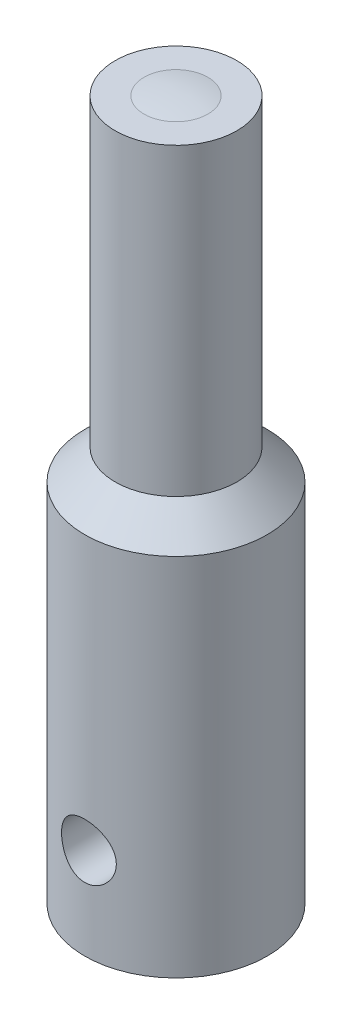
ISO-10303-21;
HEADER;
FILE_DESCRIPTION(('STEP AP214'),'2;1');
FILE_NAME('part.step','',(''),(''),'','','');
FILE_SCHEMA(('AUTOMOTIVE_DESIGN { 1 0 10303 214 1 1 1 1 }'));
ENDSEC;
DATA;
#1=APPLICATION_CONTEXT('core data for automotive mechanical design processes');
#2=APPLICATION_PROTOCOL_DEFINITION('international standard','automotive_design',2000,#1);
#3=PRODUCT_CONTEXT('',#1,'mechanical');
#4=PRODUCT('Part','Part','',(#3));
#5=PRODUCT_RELATED_PRODUCT_CATEGORY('part','',(#4));
#6=PRODUCT_DEFINITION_FORMATION('','',#4);
#7=PRODUCT_DEFINITION_CONTEXT('part definition',#1,'design');
#8=PRODUCT_DEFINITION('design','',#6,#7);
#9=PRODUCT_DEFINITION_SHAPE('','',#8);
#10=(LENGTH_UNIT() NAMED_UNIT(*) SI_UNIT(.MILLI.,.METRE.));
#11=(NAMED_UNIT(*) PLANE_ANGLE_UNIT() SI_UNIT($,.RADIAN.));
#12=(NAMED_UNIT(*) SI_UNIT($,.STERADIAN.) SOLID_ANGLE_UNIT());
#13=UNCERTAINTY_MEASURE_WITH_UNIT(LENGTH_MEASURE(1.E-05),#10,'distance_accuracy_value','');
#14=(GEOMETRIC_REPRESENTATION_CONTEXT(3) GLOBAL_UNCERTAINTY_ASSIGNED_CONTEXT((#13)) GLOBAL_UNIT_ASSIGNED_CONTEXT((#10,
#11,#12)) REPRESENTATION_CONTEXT('',''));
#15=CARTESIAN_POINT('',(0.,0.,0.));
#16=DIRECTION('',(0.,0.,1.));
#17=DIRECTION('',(1.,0.,0.));
#18=AXIS2_PLACEMENT_3D('',#15,#16,#17);
#19=CARTESIAN_POINT('',(0.,4.77990803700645,0.));
#20=DIRECTION('',(0.,-1.,0.));
#21=DIRECTION('',(1.,0.,0.));
#22=AXIS2_PLACEMENT_3D('',#19,#20,#21);
#23=CYLINDRICAL_SURFACE('',#22,1.05);
#24=CARTESIAN_POINT('',(0.,4.77990803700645,0.));
#25=DIRECTION('',(0.,-1.,0.));
#26=DIRECTION('',(1.,0.,0.));
#27=AXIS2_PLACEMENT_3D('',#24,#25,#26);
#28=CIRCLE('',#27,1.05);
#29=CARTESIAN_POINT('',(1.05,4.77990803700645,0.));
#30=VERTEX_POINT('',#29);
#31=EDGE_CURVE('E36',#30,#30,#28,.T.);
#32=ORIENTED_EDGE('',*,*,#31,.F.);
#33=EDGE_LOOP('',(#32));
#34=FACE_BOUND('',#33,.T.);
#35=CARTESIAN_POINT('',(0.,0.,0.));
#36=DIRECTION('',(0.,-1.,0.));
#37=DIRECTION('',(1.,0.,0.));
#38=AXIS2_PLACEMENT_3D('',#35,#36,#37);
#39=CIRCLE('',#38,1.05);
#40=CARTESIAN_POINT('',(1.05,0.,0.));
#41=VERTEX_POINT('',#40);
#42=EDGE_CURVE('E39',#41,#41,#39,.T.);
#43=ORIENTED_EDGE('',*,*,#42,.T.);
#44=EDGE_LOOP('',(#43));
#45=FACE_BOUND('',#44,.T.);
#46=CARTESIAN_POINT('',(-0.9,3.,0.5408326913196));
#47=CARTESIAN_POINT('',(-0.899997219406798,2.9697776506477,0.540840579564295));
#48=CARTESIAN_POINT('',(-0.898457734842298,2.93951429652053,0.543424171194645));
#49=CARTESIAN_POINT('',(-0.892472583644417,2.88001785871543,0.553192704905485));
#50=CARTESIAN_POINT('',(-0.888017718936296,2.85078834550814,0.560392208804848));
#51=CARTESIAN_POINT('',(-0.87417242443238,2.78201303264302,0.581843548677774));
#52=CARTESIAN_POINT('',(-0.863496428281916,2.74327232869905,0.597786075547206));
#53=CARTESIAN_POINT('',(-0.837838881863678,2.66897073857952,0.633253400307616));
#54=CARTESIAN_POINT('',(-0.822841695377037,2.63342202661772,0.65279111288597));
#55=CARTESIAN_POINT('',(-0.780077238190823,2.54740194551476,0.703983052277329));
#56=CARTESIAN_POINT('',(-0.749727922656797,2.49880770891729,0.736645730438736));
#57=CARTESIAN_POINT('',(-0.6802380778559,2.40794151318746,0.801274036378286));
#58=CARTESIAN_POINT('',(-0.64110664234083,2.36566308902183,0.833240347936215));
#59=CARTESIAN_POINT('',(-0.563646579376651,2.29689899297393,0.886849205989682));
#60=CARTESIAN_POINT('',(-0.527079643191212,2.26899303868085,0.909205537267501));
#61=CARTESIAN_POINT('',(-0.448683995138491,2.21843122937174,0.950333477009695));
#62=CARTESIAN_POINT('',(-0.406864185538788,2.19576667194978,0.969111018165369));
#63=CARTESIAN_POINT('',(-0.326514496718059,2.16038659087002,0.998686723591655));
#64=CARTESIAN_POINT('',(-0.288759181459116,2.1466128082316,1.01031398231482));
#65=CARTESIAN_POINT('',(-0.210763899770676,2.12408771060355,1.02941067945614));
#66=CARTESIAN_POINT('',(-0.170525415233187,2.11533343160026,1.03688257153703));
#67=CARTESIAN_POINT('',(-0.088426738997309,2.10339067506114,1.04709051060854));
#68=CARTESIAN_POINT('',(-0.0465597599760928,2.10022879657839,1.04980392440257));
#69=CARTESIAN_POINT('',(0.0372266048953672,2.09979540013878,1.05017533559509));
#70=CARTESIAN_POINT('',(0.0791459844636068,2.10252323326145,1.04783388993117));
#71=CARTESIAN_POINT('',(0.1584483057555,2.11322376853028,1.03868441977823));
#72=CARTESIAN_POINT('',(0.195931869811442,2.12077601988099,1.03223456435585));
#73=CARTESIAN_POINT('',(0.268877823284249,2.14027258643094,1.01567948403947));
#74=CARTESIAN_POINT('',(0.304339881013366,2.15221762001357,1.00557366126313));
#75=CARTESIAN_POINT('',(0.375251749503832,2.18100007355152,0.981424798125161));
#76=CARTESIAN_POINT('',(0.410494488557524,2.19814106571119,0.967140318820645));
#77=CARTESIAN_POINT('',(0.477564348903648,2.23617968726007,0.935844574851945));
#78=CARTESIAN_POINT('',(0.509388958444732,2.2570800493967,0.918831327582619));
#79=CARTESIAN_POINT('',(0.584590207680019,2.31338591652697,0.873797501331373));
#80=CARTESIAN_POINT('',(0.625729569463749,2.35080079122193,0.844543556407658));
#81=CARTESIAN_POINT('',(0.700004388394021,2.43164858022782,0.784084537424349));
#82=CARTESIAN_POINT('',(0.733120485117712,2.47509566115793,0.752874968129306));
#83=CARTESIAN_POINT('',(0.785231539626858,2.55808666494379,0.697877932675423));
#84=CARTESIAN_POINT('',(0.805730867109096,2.59656645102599,0.673895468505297));
#85=CARTESIAN_POINT('',(0.841381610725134,2.67747176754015,0.628801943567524));
#86=CARTESIAN_POINT('',(0.856549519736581,2.71988460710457,0.607682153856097));
#87=CARTESIAN_POINT('',(0.875884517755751,2.79121858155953,0.579221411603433));
#88=CARTESIAN_POINT('',(0.882024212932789,2.81873503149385,0.569750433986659));
#89=CARTESIAN_POINT('',(0.891757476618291,2.87516280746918,0.554393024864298));
#90=CARTESIAN_POINT('',(0.895357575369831,2.90407035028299,0.54849740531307));
#91=CARTESIAN_POINT('',(0.899727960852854,2.96300885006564,0.541304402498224));
#92=CARTESIAN_POINT('',(0.900468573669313,2.99304833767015,0.540055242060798));
#93=CARTESIAN_POINT('',(0.8989462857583,3.05284466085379,0.542583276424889));
#94=CARTESIAN_POINT('',(0.896680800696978,3.08260123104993,0.546364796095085));
#95=CARTESIAN_POINT('',(0.888735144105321,3.14613221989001,0.559207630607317));
#96=CARTESIAN_POINT('',(0.88251222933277,3.17966185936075,0.569099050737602));
#97=CARTESIAN_POINT('',(0.866789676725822,3.24453489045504,0.592771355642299));
#98=CARTESIAN_POINT('',(0.857278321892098,3.27586997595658,0.606566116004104));
#99=CARTESIAN_POINT('',(0.828011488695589,3.35680393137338,0.646408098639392));
#100=CARTESIAN_POINT('',(0.805672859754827,3.40447215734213,0.674445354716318));
#101=CARTESIAN_POINT('',(0.753712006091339,3.49459337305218,0.732081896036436));
#102=CARTESIAN_POINT('',(0.72407691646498,3.53703695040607,0.761683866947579));
#103=CARTESIAN_POINT('',(0.655853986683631,3.61873006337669,0.821286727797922));
#104=CARTESIAN_POINT('',(0.61688892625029,3.657709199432,0.851231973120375));
#105=CARTESIAN_POINT('',(0.530913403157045,3.72885125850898,0.907332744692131));
#106=CARTESIAN_POINT('',(0.483926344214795,3.76103341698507,0.933498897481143));
#107=CARTESIAN_POINT('',(0.397747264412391,3.80834860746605,0.972527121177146));
#108=CARTESIAN_POINT('',(0.360507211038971,3.82569290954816,0.987018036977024));
#109=CARTESIAN_POINT('',(0.282822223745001,3.85541602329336,1.01201353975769));
#110=CARTESIAN_POINT('',(0.242379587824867,3.86779835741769,1.02252095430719));
#111=CARTESIAN_POINT('',(0.158923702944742,3.88689698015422,1.03877856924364));
#112=CARTESIAN_POINT('',(0.115894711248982,3.89357378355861,1.04449561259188));
#113=CARTESIAN_POINT('',(0.0289493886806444,3.90058902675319,1.05050323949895));
#114=CARTESIAN_POINT('',(-0.0149665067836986,3.90093050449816,1.05079642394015));
#115=CARTESIAN_POINT('',(-0.0974153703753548,3.89556358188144,1.04619925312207));
#116=CARTESIAN_POINT('',(-0.136024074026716,3.89049477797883,1.04185689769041));
#117=CARTESIAN_POINT('',(-0.211624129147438,3.87561414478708,1.0291671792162));
#118=CARTESIAN_POINT('',(-0.248615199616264,3.86580149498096,1.02081912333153));
#119=CARTESIAN_POINT('',(-0.321291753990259,3.8415963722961,1.00037048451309));
#120=CARTESIAN_POINT('',(-0.356902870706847,3.82707319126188,0.988163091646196));
#121=CARTESIAN_POINT('',(-0.42507230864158,3.794196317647,0.96081479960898));
#122=CARTESIAN_POINT('',(-0.457629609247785,3.77584135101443,0.9456729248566));
#123=CARTESIAN_POINT('',(-0.53425330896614,3.72631672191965,0.905393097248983));
#124=CARTESIAN_POINT('',(-0.576382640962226,3.69321535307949,0.87893660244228));
#125=CARTESIAN_POINT('',(-0.653402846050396,3.62117718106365,0.823305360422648));
#126=CARTESIAN_POINT('',(-0.688267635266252,3.58222018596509,0.794121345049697));
#127=CARTESIAN_POINT('',(-0.751335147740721,3.49830987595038,0.734781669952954));
#128=CARTESIAN_POINT('',(-0.779390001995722,3.45325184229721,0.704618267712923));
#129=CARTESIAN_POINT('',(-0.827690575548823,3.3574836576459,0.64715545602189));
#130=CARTESIAN_POINT('',(-0.84796529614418,3.30679542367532,0.619845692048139));
#131=CARTESIAN_POINT('',(-0.871888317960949,3.22504511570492,0.585255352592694));
#132=CARTESIAN_POINT('',(-0.878833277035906,3.19636833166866,0.574680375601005));
#133=CARTESIAN_POINT('',(-0.889947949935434,3.13741757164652,0.55731474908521));
#134=CARTESIAN_POINT('',(-0.894129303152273,3.10715088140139,0.550508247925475));
#135=CARTESIAN_POINT('',(-0.89782597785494,3.0637975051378,0.544437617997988));
#136=CARTESIAN_POINT('',(-0.898638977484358,3.05109303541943,0.543092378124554));
#137=CARTESIAN_POINT('',(-0.899726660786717,3.02559484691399,0.541288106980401));
#138=CARTESIAN_POINT('',(-0.900001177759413,3.01280110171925,0.540829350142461));
#139=CARTESIAN_POINT('',(-0.9,3.,0.5408326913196));
#140=B_SPLINE_CURVE_WITH_KNOTS('',3,(#46,#47,#48,#49,#50,#51,#52,#53,#54,#55,#56,#57,#58,#59,
#60,#61,#62,#63,#64,#65,#66,#67,#68,#69,#70,#71,#72,#73,#74,#75,#76,#77,#78,#79,#80,#81,#82,#83,
#84,#85,#86,#87,#88,#89,#90,#91,#92,#93,#94,#95,#96,#97,#98,#99,#100,#101,#102,#103,#104,#105,
#106,#107,#108,#109,#110,#111,#112,#113,#114,#115,#116,#117,#118,#119,#120,#121,#122,#123,#124,
#125,#126,#127,#128,#129,#130,#131,#132,#133,#134,#135,#136,#137,#138,#139),.UNSPECIFIED.,.T.,
.F.,(4,2,2,2,2,2,2,2,2,2,2,2,2,2,2,2,2,2,2,2,2,2,2,2,2,2,2,2,2,2,2,2,2,2,2,2,2,2,2,2,2,2,2,2,2,
2,4),(0.,0.0906088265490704,0.181504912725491,0.31046116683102,0.43989003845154,
0.63676573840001,0.833438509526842,0.986315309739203,1.13893643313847,1.26393335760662,
1.38885639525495,1.51437202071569,1.63987381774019,1.75570261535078,1.8715503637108,
1.9962306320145,2.12100190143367,2.30850894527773,2.49646404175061,2.64537360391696,
2.79381837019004,2.88277418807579,2.97150042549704,3.06114497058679,3.15086663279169,
3.25679004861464,3.36309483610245,3.54107412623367,3.7193695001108,3.90668924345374,
4.09347154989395,4.22365855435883,4.3537529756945,4.48474058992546,4.61566539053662,
4.73266515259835,4.84968515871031,4.97027873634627,5.09091247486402,5.26920664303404,
5.4481303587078,5.63064768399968,5.81247788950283,5.90623852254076,5.99960170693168,
6.03796847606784,6.07634712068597),.UNSPECIFIED.);
#141=CARTESIAN_POINT('',(-0.9,3.,0.5408326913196));
#142=VERTEX_POINT('',#141);
#143=EDGE_CURVE('E48',#142,#142,#140,.T.);
#144=ORIENTED_EDGE('',*,*,#143,.T.);
#145=EDGE_LOOP('',(#144));
#146=FACE_BOUND('',#145,.T.);
#147=ADVANCED_FACE('F14',(#34,#45,#146),#23,.F.);
#148=CARTESIAN_POINT('',(0.,4.77990803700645,0.));
#149=DIRECTION('',(0.,-1.,0.));
#150=DIRECTION('',(1.,0.,0.));
#151=AXIS2_PLACEMENT_3D('',#148,#149,#150);
#152=CYLINDRICAL_SURFACE('',#151,3.);
#153=CARTESIAN_POINT('',(0.,0.,0.));
#154=DIRECTION('',(0.,-1.,0.));
#155=DIRECTION('',(1.,0.,0.));
#156=AXIS2_PLACEMENT_3D('',#153,#154,#155);
#157=CIRCLE('',#156,3.);
#158=CARTESIAN_POINT('',(3.,0.,0.));
#159=VERTEX_POINT('',#158);
#160=EDGE_CURVE('E42',#159,#159,#157,.T.);
#161=ORIENTED_EDGE('',*,*,#160,.F.);
#162=EDGE_LOOP('',(#161));
#163=FACE_BOUND('',#162,.T.);
#164=CARTESIAN_POINT('',(0.,12.,0.));
#165=DIRECTION('',(0.,1.,0.));
#166=DIRECTION('',(-1.,0.,0.));
#167=AXIS2_PLACEMENT_3D('',#164,#165,#166);
#168=CIRCLE('',#167,3.);
#169=CARTESIAN_POINT('',(-3.,12.,0.));
#170=VERTEX_POINT('',#169);
#171=EDGE_CURVE('E9',#170,#170,#168,.F.);
#172=ORIENTED_EDGE('',*,*,#171,.T.);
#173=EDGE_LOOP('',(#172));
#174=FACE_BOUND('',#173,.T.);
#175=CARTESIAN_POINT('',(-0.9,3.,2.86181760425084));
#176=CARTESIAN_POINT('',(-0.899999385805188,3.04931672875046,2.86181811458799));
#177=CARTESIAN_POINT('',(-0.895932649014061,3.09863953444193,2.86310634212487));
#178=CARTESIAN_POINT('',(-0.879815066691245,3.19584314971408,2.86809947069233));
#179=CARTESIAN_POINT('',(-0.867761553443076,3.2437234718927,2.87180517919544));
#180=CARTESIAN_POINT('',(-0.836116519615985,3.33662083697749,2.88117661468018));
#181=CARTESIAN_POINT('',(-0.816537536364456,3.38164249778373,2.88683908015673));
#182=CARTESIAN_POINT('',(-0.77043853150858,3.4677731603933,2.89948159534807));
#183=CARTESIAN_POINT('',(-0.743917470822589,3.50888157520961,2.90646184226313));
#184=CARTESIAN_POINT('',(-0.68378852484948,3.58731983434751,2.92120117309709));
#185=CARTESIAN_POINT('',(-0.649999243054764,3.62450753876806,2.92897684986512));
#186=CARTESIAN_POINT('',(-0.576681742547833,3.69278277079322,2.94428917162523));
#187=CARTESIAN_POINT('',(-0.537152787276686,3.72386951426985,2.9518257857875));
#188=CARTESIAN_POINT('',(-0.452466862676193,3.77967761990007,2.96599928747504));
#189=CARTESIAN_POINT('',(-0.407210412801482,3.80425405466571,2.97261434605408));
#190=CARTESIAN_POINT('',(-0.312974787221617,3.84539235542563,2.98400661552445));
#191=CARTESIAN_POINT('',(-0.263996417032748,3.86195594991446,2.98878422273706));
#192=CARTESIAN_POINT('',(-0.165194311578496,3.88612800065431,2.99584587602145));
#193=CARTESIAN_POINT('',(-0.11543483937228,3.89397907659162,2.99819734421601));
#194=CARTESIAN_POINT('',(-0.0152530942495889,3.90127039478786,3.00037920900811));
#195=CARTESIAN_POINT('',(0.0351690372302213,3.90071240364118,3.00021013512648));
#196=CARTESIAN_POINT('',(0.133542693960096,3.89136427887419,2.99741762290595));
#197=CARTESIAN_POINT('',(0.181521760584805,3.88283688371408,2.99487252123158));
#198=CARTESIAN_POINT('',(0.275333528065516,3.85822119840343,2.98770913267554));
#199=CARTESIAN_POINT('',(0.321166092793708,3.8421324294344,2.98309071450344));
#200=CARTESIAN_POINT('',(0.410008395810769,3.80267278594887,2.97219132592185));
#201=CARTESIAN_POINT('',(0.452979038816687,3.77921927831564,2.96589161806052));
#202=CARTESIAN_POINT('',(0.534458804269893,3.72576128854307,2.95229784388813));
#203=CARTESIAN_POINT('',(0.572966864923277,3.69575525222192,2.94500354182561));
#204=CARTESIAN_POINT('',(0.645996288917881,3.62868134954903,2.92986930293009));
#205=CARTESIAN_POINT('',(0.680306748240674,3.59138584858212,2.92201917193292));
#206=CARTESIAN_POINT('',(0.742245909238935,3.51149398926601,2.90690387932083));
#207=CARTESIAN_POINT('',(0.769873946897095,3.46889710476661,2.89963877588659));
#208=CARTESIAN_POINT('',(0.817883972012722,3.37905631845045,2.88646741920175));
#209=CARTESIAN_POINT('',(0.838193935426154,3.33177177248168,2.88057486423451));
#210=CARTESIAN_POINT('',(0.870500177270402,3.23423567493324,2.87097835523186));
#211=CARTESIAN_POINT('',(0.882499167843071,3.18398509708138,2.86727368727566));
#212=CARTESIAN_POINT('',(0.897448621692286,3.08395058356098,2.8626290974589));
#213=CARTESIAN_POINT('',(0.900719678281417,3.03421906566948,2.8615912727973));
#214=CARTESIAN_POINT('',(0.899015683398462,2.9349162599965,2.86212715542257));
#215=CARTESIAN_POINT('',(0.894041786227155,2.88534495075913,2.86370049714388));
#216=CARTESIAN_POINT('',(0.876274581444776,2.78910697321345,2.8691853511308));
#217=CARTESIAN_POINT('',(0.863687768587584,2.74239830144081,2.87303505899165));
#218=CARTESIAN_POINT('',(0.831291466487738,2.65175898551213,2.88257484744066));
#219=CARTESIAN_POINT('',(0.811480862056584,2.60782877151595,2.8882652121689));
#220=CARTESIAN_POINT('',(0.764591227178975,2.52268952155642,2.90103501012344));
#221=CARTESIAN_POINT('',(0.737331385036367,2.48158516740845,2.90814762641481));
#222=CARTESIAN_POINT('',(0.676531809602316,2.4044171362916,2.92288923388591));
#223=CARTESIAN_POINT('',(0.642990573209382,2.36835466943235,2.9305183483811));
#224=CARTESIAN_POINT('',(0.569073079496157,2.30089175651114,2.94578180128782));
#225=CARTESIAN_POINT('',(0.52848663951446,2.2697186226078,2.95340547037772));
#226=CARTESIAN_POINT('',(0.44247707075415,2.21461997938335,2.96750911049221));
#227=CARTESIAN_POINT('',(0.397054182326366,2.19069411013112,2.97398913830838));
#228=CARTESIAN_POINT('',(0.302961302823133,2.15099998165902,2.98503582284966));
#229=CARTESIAN_POINT('',(0.254318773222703,2.13517079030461,2.98961672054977));
#230=CARTESIAN_POINT('',(0.154901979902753,2.11196344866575,2.99641187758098));
#231=CARTESIAN_POINT('',(0.104128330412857,2.10458288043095,2.99862681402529));
#232=CARTESIAN_POINT('',(0.00399129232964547,2.0986661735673,3.00039926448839));
#233=CARTESIAN_POINT('',(-0.0453511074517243,2.0998003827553,3.00005583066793));
#234=CARTESIAN_POINT('',(-0.143111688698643,2.11009297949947,2.99698358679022));
#235=CARTESIAN_POINT('',(-0.191529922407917,2.11925091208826,2.99425491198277));
#236=CARTESIAN_POINT('',(-0.285561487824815,2.14512699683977,2.98674701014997));
#237=CARTESIAN_POINT('',(-0.331199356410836,2.16176290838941,2.98199011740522));
#238=CARTESIAN_POINT('',(-0.419059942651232,2.20204914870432,2.97091765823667));
#239=CARTESIAN_POINT('',(-0.461282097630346,2.22570063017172,2.96460183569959));
#240=CARTESIAN_POINT('',(-0.542581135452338,2.28022407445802,2.95082379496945));
#241=CARTESIAN_POINT('',(-0.581514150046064,2.31130285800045,2.94333136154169));
#242=CARTESIAN_POINT('',(-0.653722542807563,2.37942623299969,2.92814122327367));
#243=CARTESIAN_POINT('',(-0.686996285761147,2.41647254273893,2.92044345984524));
#244=CARTESIAN_POINT('',(-0.747937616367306,2.49680446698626,2.90544408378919));
#245=CARTESIAN_POINT('',(-0.775408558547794,2.5402431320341,2.89816111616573));
#246=CARTESIAN_POINT('',(-0.822625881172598,2.63133310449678,2.88511528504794));
#247=CARTESIAN_POINT('',(-0.842375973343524,2.67898237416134,2.87935169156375));
#248=CARTESIAN_POINT('',(-0.871811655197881,2.77184425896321,2.87056690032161));
#249=CARTESIAN_POINT('',(-0.882353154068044,2.81676518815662,2.86731692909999));
#250=CARTESIAN_POINT('',(-0.896446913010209,2.90778913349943,2.86294225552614));
#251=CARTESIAN_POINT('',(-0.900000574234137,2.95389191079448,2.86181712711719));
#252=CARTESIAN_POINT('',(-0.9,3.,2.86181760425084));
#253=B_SPLINE_CURVE_WITH_KNOTS('',3,(#175,#176,#177,#178,#179,#180,#181,#182,#183,#184,#185,
#186,#187,#188,#189,#190,#191,#192,#193,#194,#195,#196,#197,#198,#199,#200,#201,#202,#203,#204,
#205,#206,#207,#208,#209,#210,#211,#212,#213,#214,#215,#216,#217,#218,#219,#220,#221,#222,#223,
#224,#225,#226,#227,#228,#229,#230,#231,#232,#233,#234,#235,#236,#237,#238,#239,#240,#241,#242,
#243,#244,#245,#246,#247,#248,#249,#250,#251,#252),.UNSPECIFIED.,.T.,.F.,(4,2,2,2,2,2,2,2,2,2,2,
2,2,2,2,2,2,2,2,2,2,2,2,2,2,2,2,2,2,2,2,2,2,2,2,2,2,2,4),(0.,0.147780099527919,
0.295609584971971,0.443193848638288,0.590800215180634,0.742638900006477,0.894497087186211,
1.04949563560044,1.20446073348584,1.35499284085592,1.50549332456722,1.65120075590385,
1.79691741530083,1.94433125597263,2.09178009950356,2.24491288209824,2.39806087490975,
2.55267742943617,2.70724350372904,2.85604848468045,3.00483263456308,3.14975156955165,
3.29469288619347,3.44352439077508,3.59239155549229,3.74687703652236,3.90135484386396,
4.0546523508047,4.20790597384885,4.35525782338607,4.50260131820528,4.64836258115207,
4.79414780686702,4.94459776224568,5.09509111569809,5.25006983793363,5.40497396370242,
5.54316692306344,5.68133217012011),.UNSPECIFIED.);
#254=CARTESIAN_POINT('',(-0.9,3.,2.86181760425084));
#255=VERTEX_POINT('',#254);
#256=EDGE_CURVE('E18',#255,#255,#253,.T.);
#257=ORIENTED_EDGE('',*,*,#256,.T.);
#258=EDGE_LOOP('',(#257));
#259=FACE_BOUND('',#258,.T.);
#260=ADVANCED_FACE('F61',(#163,#174,#259),#152,.T.);
#261=CARTESIAN_POINT('',(0.,4.77990803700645,0.));
#262=DIRECTION('',(0.,-1.,0.));
#263=DIRECTION('',(1.,0.,0.));
#264=AXIS2_PLACEMENT_3D('',#261,#262,#263);
#265=CYLINDRICAL_SURFACE('',#264,2.);
#266=CARTESIAN_POINT('',(0.,23.,0.));
#267=DIRECTION('',(0.,-1.,0.));
#268=DIRECTION('',(1.,0.,0.));
#269=AXIS2_PLACEMENT_3D('',#266,#267,#268);
#270=CIRCLE('',#269,2.);
#271=CARTESIAN_POINT('',(2.,23.,0.));
#272=VERTEX_POINT('',#271);
#273=EDGE_CURVE('E27',#272,#272,#270,.T.);
#274=ORIENTED_EDGE('',*,*,#273,.T.);
#275=EDGE_LOOP('',(#274));
#276=FACE_BOUND('',#275,.T.);
#277=CARTESIAN_POINT('',(0.,13.,0.));
#278=DIRECTION('',(0.,-1.,0.));
#279=DIRECTION('',(1.,0.,0.));
#280=AXIS2_PLACEMENT_3D('',#277,#278,#279);
#281=CIRCLE('',#280,2.);
#282=CARTESIAN_POINT('',(2.,13.,0.));
#283=VERTEX_POINT('',#282);
#284=EDGE_CURVE('E45',#283,#283,#281,.T.);
#285=ORIENTED_EDGE('',*,*,#284,.F.);
#286=EDGE_LOOP('',(#285));
#287=FACE_BOUND('',#286,.T.);
#288=ADVANCED_FACE('F65',(#276,#287),#265,.T.);
#289=CARTESIAN_POINT('',(1.05,23.,0.));
#290=DIRECTION('',(0.,1.,0.));
#291=DIRECTION('',(-1.,0.,0.));
#292=AXIS2_PLACEMENT_3D('',#289,#290,#291);
#293=PLANE('',#292);
#294=CARTESIAN_POINT('',(0.,23.,0.));
#295=DIRECTION('',(0.,-1.,0.));
#296=DIRECTION('',(1.,0.,0.));
#297=AXIS2_PLACEMENT_3D('',#294,#295,#296);
#298=CIRCLE('',#297,1.05);
#299=CARTESIAN_POINT('',(1.05,23.,0.));
#300=VERTEX_POINT('',#299);
#301=EDGE_CURVE('E31',#300,#300,#298,.T.);
#302=ORIENTED_EDGE('',*,*,#301,.T.);
#303=EDGE_LOOP('',(#302));
#304=FACE_BOUND('',#303,.T.);
#305=ORIENTED_EDGE('',*,*,#273,.F.);
#306=EDGE_LOOP('',(#305));
#307=FACE_BOUND('',#306,.T.);
#308=ADVANCED_FACE('F112',(#304,#307),#293,.T.);
#309=CARTESIAN_POINT('',(0.,17.5187586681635,0.));
#310=DIRECTION('',(0.,-1.,0.));
#311=DIRECTION('',(1.,0.,0.));
#312=AXIS2_PLACEMENT_3D('',#309,#310,#311);
#313=SPHERICAL_SURFACE('',#312,5.58090553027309);
#314=ORIENTED_EDGE('',*,*,#301,.F.);
#315=EDGE_LOOP('',(#314));
#316=FACE_BOUND('',#315,.T.);
#317=ADVANCED_FACE('F78',(#316),#313,.T.);
#318=CARTESIAN_POINT('',(1.05,4.77990803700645,0.));
#319=DIRECTION('',(0.,-1.,0.));
#320=DIRECTION('',(1.,0.,0.));
#321=AXIS2_PLACEMENT_3D('',#318,#319,#320);
#322=PLANE('',#321);
#323=ORIENTED_EDGE('',*,*,#31,.T.);
#324=EDGE_LOOP('',(#323));
#325=FACE_BOUND('',#324,.T.);
#326=ADVANCED_FACE('F69',(#325),#322,.T.);
#327=CARTESIAN_POINT('',(3.,0.,0.));
#328=DIRECTION('',(0.,-1.,0.));
#329=DIRECTION('',(1.,0.,0.));
#330=AXIS2_PLACEMENT_3D('',#327,#328,#329);
#331=PLANE('',#330);
#332=ORIENTED_EDGE('',*,*,#160,.T.);
#333=EDGE_LOOP('',(#332));
#334=FACE_BOUND('',#333,.T.);
#335=ORIENTED_EDGE('',*,*,#42,.F.);
#336=EDGE_LOOP('',(#335));
#337=FACE_BOUND('',#336,.T.);
#338=ADVANCED_FACE('F67',(#334,#337),#331,.T.);
#339=CARTESIAN_POINT('',(0.,12.,0.));
#340=DIRECTION('',(0.,-1.,0.));
#341=DIRECTION('',(1.,0.,0.));
#342=AXIS2_PLACEMENT_3D('',#339,#340,#341);
#343=CONICAL_SURFACE('',#342,3.,0.78539816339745);
#344=ORIENTED_EDGE('',*,*,#284,.T.);
#345=EDGE_LOOP('',(#344));
#346=FACE_BOUND('',#345,.T.);
#347=ORIENTED_EDGE('',*,*,#171,.F.);
#348=EDGE_LOOP('',(#347));
#349=FACE_BOUND('',#348,.T.);
#350=ADVANCED_FACE('F16',(#346,#349),#343,.T.);
#351=CARTESIAN_POINT('',(0.,3.,5.));
#352=DIRECTION('',(0.,0.,-1.));
#353=DIRECTION('',(-1.,0.,0.));
#354=AXIS2_PLACEMENT_3D('',#351,#352,#353);
#355=CYLINDRICAL_SURFACE('',#354,0.9);
#356=ORIENTED_EDGE('',*,*,#143,.F.);
#357=EDGE_LOOP('',(#356));
#358=FACE_BOUND('',#357,.T.);
#359=ORIENTED_EDGE('',*,*,#256,.F.);
#360=EDGE_LOOP('',(#359));
#361=FACE_BOUND('',#360,.T.);
#362=ADVANCED_FACE('F57',(#358,#361),#355,.F.);
#363=CLOSED_SHELL('',(#147,#260,#288,#308,#317,#326,#338,#350,#362));
#364=MANIFOLD_SOLID_BREP('B1',#363);
#365=ADVANCED_BREP_SHAPE_REPRESENTATION('',(#18,#364),#14);
#366=SHAPE_DEFINITION_REPRESENTATION(#9,#365);
ENDSEC;
END-ISO-10303-21;
